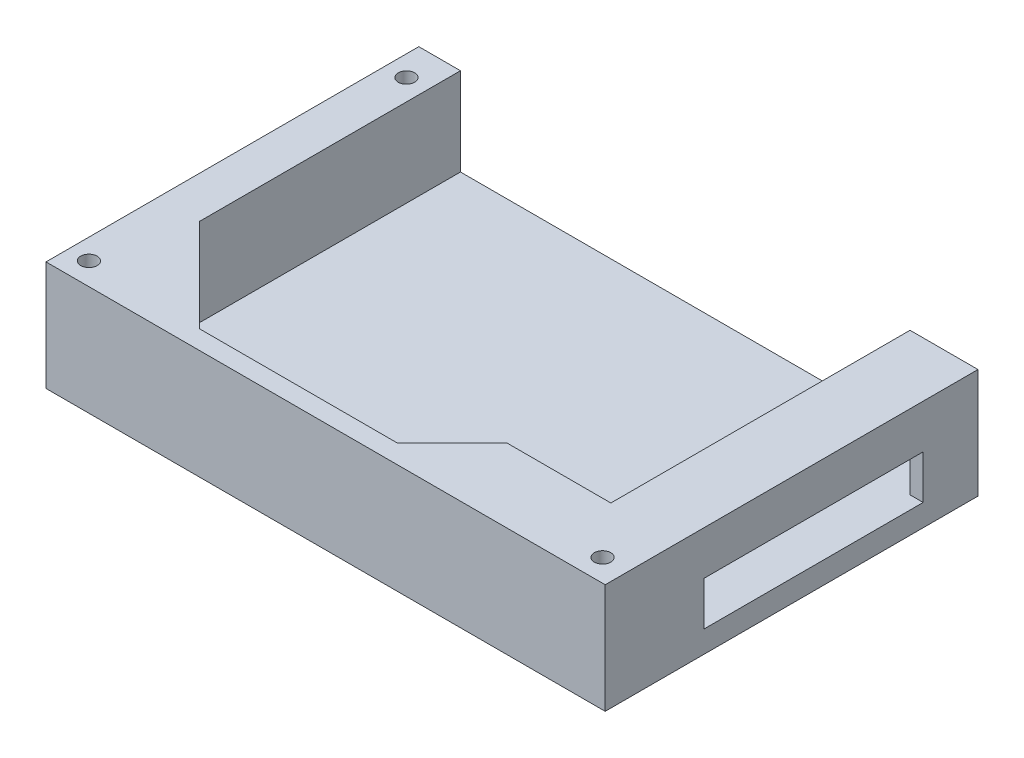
ISO-10303-21;
HEADER;
FILE_DESCRIPTION(('STEP AP214'),'2;1');
FILE_NAME('part.step','',(''),(''),'','','');
FILE_SCHEMA(('AUTOMOTIVE_DESIGN { 1 0 10303 214 1 1 1 1 }'));
ENDSEC;
DATA;
#1=APPLICATION_CONTEXT('core data for automotive mechanical design processes');
#2=APPLICATION_PROTOCOL_DEFINITION('international standard','automotive_design',2000,#1);
#3=PRODUCT_CONTEXT('',#1,'mechanical');
#4=PRODUCT('Part','Part','',(#3));
#5=PRODUCT_RELATED_PRODUCT_CATEGORY('part','',(#4));
#6=PRODUCT_DEFINITION_FORMATION('','',#4);
#7=PRODUCT_DEFINITION_CONTEXT('part definition',#1,'design');
#8=PRODUCT_DEFINITION('design','',#6,#7);
#9=PRODUCT_DEFINITION_SHAPE('','',#8);
#10=(LENGTH_UNIT() NAMED_UNIT(*) SI_UNIT(.MILLI.,.METRE.));
#11=(NAMED_UNIT(*) PLANE_ANGLE_UNIT() SI_UNIT($,.RADIAN.));
#12=(NAMED_UNIT(*) SI_UNIT($,.STERADIAN.) SOLID_ANGLE_UNIT());
#13=UNCERTAINTY_MEASURE_WITH_UNIT(LENGTH_MEASURE(1.E-05),#10,'distance_accuracy_value','');
#14=(GEOMETRIC_REPRESENTATION_CONTEXT(3) GLOBAL_UNCERTAINTY_ASSIGNED_CONTEXT((#13)) GLOBAL_UNIT_ASSIGNED_CONTEXT((#10,
#11,#12)) REPRESENTATION_CONTEXT('',''));
#15=CARTESIAN_POINT('',(0.,0.,0.));
#16=DIRECTION('',(0.,0.,1.));
#17=DIRECTION('',(1.,0.,0.));
#18=AXIS2_PLACEMENT_3D('',#15,#16,#17);
#19=CARTESIAN_POINT('',(0.,20.,0.));
#20=DIRECTION('',(0.,1.,0.));
#21=DIRECTION('',(0.,0.,1.));
#22=AXIS2_PLACEMENT_3D('',#19,#20,#21);
#23=PLANE('',#22);
#24=CARTESIAN_POINT('',(3.75,20.,-62.));
#25=DIRECTION('',(0.,1.,0.));
#26=DIRECTION('',(0.,0.,1.));
#27=AXIS2_PLACEMENT_3D('',#24,#25,#26);
#28=CIRCLE('',#27,1.5);
#29=CARTESIAN_POINT('',(3.75,20.,-60.5));
#30=VERTEX_POINT('',#29);
#31=EDGE_CURVE('E585',#30,#30,#28,.T.);
#32=ORIENTED_EDGE('',*,*,#31,.F.);
#33=EDGE_LOOP('',(#32));
#34=FACE_BOUND('',#33,.T.);
#35=CARTESIAN_POINT('',(3.75,20.,-4.07617639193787));
#36=DIRECTION('',(0.,1.,0.));
#37=DIRECTION('',(0.,0.,1.));
#38=AXIS2_PLACEMENT_3D('',#35,#36,#37);
#39=CIRCLE('',#38,1.5);
#40=CARTESIAN_POINT('',(3.75,20.,-2.57617639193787));
#41=VERTEX_POINT('',#40);
#42=EDGE_CURVE('E587',#41,#41,#39,.T.);
#43=ORIENTED_EDGE('',*,*,#42,.F.);
#44=EDGE_LOOP('',(#43));
#45=FACE_BOUND('',#44,.T.);
#46=CARTESIAN_POINT('',(97.441924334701,20.,-4.07617639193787));
#47=DIRECTION('',(0.,1.,0.));
#48=DIRECTION('',(0.,0.,1.));
#49=AXIS2_PLACEMENT_3D('',#46,#47,#48);
#50=CIRCLE('',#49,1.5);
#51=CARTESIAN_POINT('',(97.441924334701,20.,-2.57617639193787));
#52=VERTEX_POINT('',#51);
#53=EDGE_CURVE('E599',#52,#52,#50,.T.);
#54=ORIENTED_EDGE('',*,*,#53,.F.);
#55=EDGE_LOOP('',(#54));
#56=FACE_BOUND('',#55,.T.);
#57=DIRECTION('',(0.,0.,1.));
#58=VECTOR('',#57,1.);
#59=CARTESIAN_POINT('',(89.602187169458,20.,-68.));
#60=LINE('',#59,#58);
#61=CARTESIAN_POINT('',(89.602187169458,20.,-68.));
#62=VERTEX_POINT('',#61);
#63=CARTESIAN_POINT('',(89.602187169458,20.,-13.4315313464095));
#64=VERTEX_POINT('',#63);
#65=EDGE_CURVE('E215',#62,#64,#60,.T.);
#66=ORIENTED_EDGE('',*,*,#65,.T.);
#67=DIRECTION('',(-1.,0.,0.));
#68=VECTOR('',#67,1.);
#69=CARTESIAN_POINT('',(0.,20.,-13.4315313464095));
#70=LINE('',#69,#68);
#71=CARTESIAN_POINT('',(70.602187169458,20.,-13.4315313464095));
#72=VERTEX_POINT('',#71);
#73=EDGE_CURVE('E330',#64,#72,#70,.T.);
#74=ORIENTED_EDGE('',*,*,#73,.T.);
#75=DIRECTION('',(-0.707106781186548,0.,0.707106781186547));
#76=VECTOR('',#75,1.);
#77=CARTESIAN_POINT('',(28.5853279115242,20.,28.5853279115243));
#78=LINE('',#77,#76);
#79=CARTESIAN_POINT('',(60.602187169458,20.,-3.4315313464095));
#80=VERTEX_POINT('',#79);
#81=EDGE_CURVE('E333',#72,#80,#78,.T.);
#82=ORIENTED_EDGE('',*,*,#81,.T.);
#83=DIRECTION('',(-1.,0.,0.));
#84=VECTOR('',#83,1.);
#85=CARTESIAN_POINT('',(0.,20.,-3.4315313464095));
#86=LINE('',#85,#84);
#87=CARTESIAN_POINT('',(24.602187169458,20.,-3.4315313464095));
#88=VERTEX_POINT('',#87);
#89=EDGE_CURVE('E337',#80,#88,#86,.T.);
#90=ORIENTED_EDGE('',*,*,#89,.T.);
#91=DIRECTION('',(-0.707106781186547,0.,-0.707106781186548));
#92=VECTOR('',#91,1.);
#93=CARTESIAN_POINT('',(14.0168592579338,20.,-14.0168592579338));
#94=LINE('',#93,#92);
#95=CARTESIAN_POINT('',(7.60218716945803,20.,-20.4315313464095));
#96=VERTEX_POINT('',#95);
#97=EDGE_CURVE('E341',#88,#96,#94,.T.);
#98=ORIENTED_EDGE('',*,*,#97,.T.);
#99=DIRECTION('',(0.,0.,-1.));
#100=VECTOR('',#99,1.);
#101=CARTESIAN_POINT('',(7.60218716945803,20.,0.));
#102=LINE('',#101,#100);
#103=CARTESIAN_POINT('',(7.60218716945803,20.,-68.));
#104=VERTEX_POINT('',#103);
#105=EDGE_CURVE('E52',#96,#104,#102,.T.);
#106=ORIENTED_EDGE('',*,*,#105,.T.);
#107=DIRECTION('',(-1.,0.,0.));
#108=VECTOR('',#107,1.);
#109=CARTESIAN_POINT('',(102.,20.,-68.));
#110=LINE('',#109,#108);
#111=CARTESIAN_POINT('',(0.,20.,-68.));
#112=VERTEX_POINT('',#111);
#113=EDGE_CURVE('E68',#104,#112,#110,.T.);
#114=ORIENTED_EDGE('',*,*,#113,.T.);
#115=DIRECTION('',(0.,0.,1.));
#116=VECTOR('',#115,1.);
#117=CARTESIAN_POINT('',(0.,20.,-68.));
#118=LINE('',#117,#116);
#119=CARTESIAN_POINT('',(0.,20.,0.));
#120=VERTEX_POINT('',#119);
#121=EDGE_CURVE('E295',#112,#120,#118,.T.);
#122=ORIENTED_EDGE('',*,*,#121,.T.);
#123=DIRECTION('',(1.,0.,0.));
#124=VECTOR('',#123,1.);
#125=CARTESIAN_POINT('',(0.,20.,0.));
#126=LINE('',#125,#124);
#127=CARTESIAN_POINT('',(102.,20.,0.));
#128=VERTEX_POINT('',#127);
#129=EDGE_CURVE('E98',#120,#128,#126,.T.);
#130=ORIENTED_EDGE('',*,*,#129,.T.);
#131=DIRECTION('',(0.,0.,-1.));
#132=VECTOR('',#131,1.);
#133=CARTESIAN_POINT('',(102.,20.,0.));
#134=LINE('',#133,#132);
#135=CARTESIAN_POINT('',(102.,20.,-68.));
#136=VERTEX_POINT('',#135);
#137=EDGE_CURVE('E300',#128,#136,#134,.T.);
#138=ORIENTED_EDGE('',*,*,#137,.T.);
#139=EDGE_CURVE('E303',#136,#62,#110,.T.);
#140=ORIENTED_EDGE('',*,*,#139,.T.);
#141=EDGE_LOOP('',(#66,#74,#82,#90,#98,#106,#114,#122,#130,#138,#140));
#142=FACE_BOUND('',#141,.T.);
#143=ADVANCED_FACE('F43',(#34,#45,#56,#142),#23,.T.);
#144=CARTESIAN_POINT('',(0.,20.,-68.));
#145=DIRECTION('',(1.,0.,0.));
#146=DIRECTION('',(0.,0.,-1.));
#147=AXIS2_PLACEMENT_3D('',#144,#145,#146);
#148=PLANE('',#147);
#149=DIRECTION('',(0.,0.,1.));
#150=VECTOR('',#149,1.);
#151=CARTESIAN_POINT('',(0.,0.,-68.));
#152=LINE('',#151,#150);
#153=CARTESIAN_POINT('',(0.,0.,-68.));
#154=VERTEX_POINT('',#153);
#155=CARTESIAN_POINT('',(0.,0.,0.));
#156=VERTEX_POINT('',#155);
#157=EDGE_CURVE('E294',#154,#156,#152,.T.);
#158=ORIENTED_EDGE('',*,*,#157,.T.);
#159=DIRECTION('',(0.,-1.,0.));
#160=VECTOR('',#159,1.);
#161=CARTESIAN_POINT('',(0.,20.,0.));
#162=LINE('',#161,#160);
#163=EDGE_CURVE('E327',#120,#156,#162,.T.);
#164=ORIENTED_EDGE('',*,*,#163,.F.);
#165=ORIENTED_EDGE('',*,*,#121,.F.);
#166=DIRECTION('',(0.,-1.,0.));
#167=VECTOR('',#166,1.);
#168=CARTESIAN_POINT('',(0.,20.,-68.));
#169=LINE('',#168,#167);
#170=EDGE_CURVE('E306',#112,#154,#169,.T.);
#171=ORIENTED_EDGE('',*,*,#170,.T.);
#172=EDGE_LOOP('',(#158,#164,#165,#171));
#173=FACE_BOUND('',#172,.T.);
#174=ADVANCED_FACE('F45',(#173),#148,.F.);
#175=CARTESIAN_POINT('',(0.,20.,0.));
#176=DIRECTION('',(0.,0.,-1.));
#177=DIRECTION('',(-1.,0.,0.));
#178=AXIS2_PLACEMENT_3D('',#175,#176,#177);
#179=PLANE('',#178);
#180=DIRECTION('',(1.,0.,0.));
#181=VECTOR('',#180,1.);
#182=CARTESIAN_POINT('',(0.,0.,0.));
#183=LINE('',#182,#181);
#184=CARTESIAN_POINT('',(102.,0.,0.));
#185=VERTEX_POINT('',#184);
#186=EDGE_CURVE('E310',#156,#185,#183,.T.);
#187=ORIENTED_EDGE('',*,*,#186,.T.);
#188=DIRECTION('',(0.,-1.,0.));
#189=VECTOR('',#188,1.);
#190=CARTESIAN_POINT('',(102.,20.,0.));
#191=LINE('',#190,#189);
#192=EDGE_CURVE('E323',#128,#185,#191,.T.);
#193=ORIENTED_EDGE('',*,*,#192,.F.);
#194=ORIENTED_EDGE('',*,*,#129,.F.);
#195=ORIENTED_EDGE('',*,*,#163,.T.);
#196=EDGE_LOOP('',(#187,#193,#194,#195));
#197=FACE_BOUND('',#196,.T.);
#198=ADVANCED_FACE('F358',(#197),#179,.F.);
#199=CARTESIAN_POINT('',(102.,20.,0.));
#200=DIRECTION('',(-1.,0.,0.));
#201=DIRECTION('',(0.,0.,1.));
#202=AXIS2_PLACEMENT_3D('',#199,#200,#201);
#203=PLANE('',#202);
#204=DIRECTION('',(0.,0.,1.));
#205=VECTOR('',#204,1.);
#206=CARTESIAN_POINT('',(102.,12.,-58.));
#207=LINE('',#206,#205);
#208=CARTESIAN_POINT('',(102.,12.,-58.));
#209=VERTEX_POINT('',#208);
#210=CARTESIAN_POINT('',(102.,12.,-18.));
#211=VERTEX_POINT('',#210);
#212=EDGE_CURVE('E188',#209,#211,#207,.T.);
#213=ORIENTED_EDGE('',*,*,#212,.F.);
#214=DIRECTION('',(0.,1.,0.));
#215=VECTOR('',#214,1.);
#216=CARTESIAN_POINT('',(102.,12.,-58.));
#217=LINE('',#216,#215);
#218=CARTESIAN_POINT('',(102.,4.,-58.));
#219=VERTEX_POINT('',#218);
#220=EDGE_CURVE('E59',#219,#209,#217,.T.);
#221=ORIENTED_EDGE('',*,*,#220,.F.);
#222=DIRECTION('',(0.,0.,-1.));
#223=VECTOR('',#222,1.);
#224=CARTESIAN_POINT('',(102.,4.,-58.));
#225=LINE('',#224,#223);
#226=CARTESIAN_POINT('',(102.,3.99999999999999,-18.));
#227=VERTEX_POINT('',#226);
#228=EDGE_CURVE('E196',#227,#219,#225,.T.);
#229=ORIENTED_EDGE('',*,*,#228,.F.);
#230=DIRECTION('',(0.,-1.,0.));
#231=VECTOR('',#230,1.);
#232=CARTESIAN_POINT('',(102.,12.,-18.));
#233=LINE('',#232,#231);
#234=EDGE_CURVE('E177',#211,#227,#233,.T.);
#235=ORIENTED_EDGE('',*,*,#234,.F.);
#236=EDGE_LOOP('',(#213,#221,#229,#235));
#237=FACE_BOUND('',#236,.T.);
#238=DIRECTION('',(0.,0.,-1.));
#239=VECTOR('',#238,1.);
#240=CARTESIAN_POINT('',(102.,0.,0.));
#241=LINE('',#240,#239);
#242=CARTESIAN_POINT('',(102.,0.,-68.));
#243=VERTEX_POINT('',#242);
#244=EDGE_CURVE('E313',#185,#243,#241,.T.);
#245=ORIENTED_EDGE('',*,*,#244,.T.);
#246=DIRECTION('',(0.,-1.,0.));
#247=VECTOR('',#246,1.);
#248=CARTESIAN_POINT('',(102.,20.,-68.));
#249=LINE('',#248,#247);
#250=EDGE_CURVE('E320',#136,#243,#249,.T.);
#251=ORIENTED_EDGE('',*,*,#250,.F.);
#252=ORIENTED_EDGE('',*,*,#137,.F.);
#253=ORIENTED_EDGE('',*,*,#192,.T.);
#254=EDGE_LOOP('',(#245,#251,#252,#253));
#255=FACE_BOUND('',#254,.T.);
#256=ADVANCED_FACE('F193',(#237,#255),#203,.F.);
#257=CARTESIAN_POINT('',(102.,20.,-68.));
#258=DIRECTION('',(0.,0.,1.));
#259=DIRECTION('',(1.,0.,0.));
#260=AXIS2_PLACEMENT_3D('',#257,#258,#259);
#261=PLANE('',#260);
#262=DIRECTION('',(-1.,0.,0.));
#263=VECTOR('',#262,1.);
#264=CARTESIAN_POINT('',(99.602187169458,4.,-68.));
#265=LINE('',#264,#263);
#266=CARTESIAN_POINT('',(99.602187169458,4.,-68.));
#267=VERTEX_POINT('',#266);
#268=CARTESIAN_POINT('',(7.60218716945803,4.,-68.));
#269=VERTEX_POINT('',#268);
#270=EDGE_CURVE('E240',#267,#269,#265,.T.);
#271=ORIENTED_EDGE('',*,*,#270,.F.);
#272=DIRECTION('',(0.,1.,0.));
#273=VECTOR('',#272,1.);
#274=CARTESIAN_POINT('',(99.602187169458,4.,-68.));
#275=LINE('',#274,#273);
#276=CARTESIAN_POINT('',(99.602187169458,12.,-68.));
#277=VERTEX_POINT('',#276);
#278=EDGE_CURVE('E244',#267,#277,#275,.T.);
#279=ORIENTED_EDGE('',*,*,#278,.T.);
#280=DIRECTION('',(-1.,0.,0.));
#281=VECTOR('',#280,1.);
#282=CARTESIAN_POINT('',(99.602187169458,12.,-68.));
#283=LINE('',#282,#281);
#284=CARTESIAN_POINT('',(89.602187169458,12.,-68.));
#285=VERTEX_POINT('',#284);
#286=EDGE_CURVE('E216',#277,#285,#283,.T.);
#287=ORIENTED_EDGE('',*,*,#286,.T.);
#288=DIRECTION('',(0.,1.,0.));
#289=VECTOR('',#288,1.);
#290=CARTESIAN_POINT('',(89.602187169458,12.,-68.));
#291=LINE('',#290,#289);
#292=EDGE_CURVE('E227',#285,#62,#291,.T.);
#293=ORIENTED_EDGE('',*,*,#292,.T.);
#294=ORIENTED_EDGE('',*,*,#139,.F.);
#295=ORIENTED_EDGE('',*,*,#250,.T.);
#296=DIRECTION('',(-1.,0.,0.));
#297=VECTOR('',#296,1.);
#298=CARTESIAN_POINT('',(102.,0.,-68.));
#299=LINE('',#298,#297);
#300=EDGE_CURVE('E90',#243,#154,#299,.T.);
#301=ORIENTED_EDGE('',*,*,#300,.T.);
#302=ORIENTED_EDGE('',*,*,#170,.F.);
#303=ORIENTED_EDGE('',*,*,#113,.F.);
#304=DIRECTION('',(0.,1.,0.));
#305=VECTOR('',#304,1.);
#306=CARTESIAN_POINT('',(7.60218716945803,4.,-68.));
#307=LINE('',#306,#305);
#308=EDGE_CURVE('E245',#269,#104,#307,.T.);
#309=ORIENTED_EDGE('',*,*,#308,.F.);
#310=EDGE_LOOP('',(#271,#279,#287,#293,#294,#295,#301,#302,#303,#309));
#311=FACE_BOUND('',#310,.T.);
#312=ADVANCED_FACE('F350',(#311),#261,.F.);
#313=CARTESIAN_POINT('',(0.,0.,0.));
#314=DIRECTION('',(0.,1.,0.));
#315=DIRECTION('',(0.,0.,1.));
#316=AXIS2_PLACEMENT_3D('',#313,#314,#315);
#317=PLANE('',#316);
#318=CARTESIAN_POINT('',(3.75,0.,-62.));
#319=DIRECTION('',(0.,1.,0.));
#320=DIRECTION('',(0.,0.,1.));
#321=AXIS2_PLACEMENT_3D('',#318,#319,#320);
#322=CIRCLE('',#321,1.5);
#323=CARTESIAN_POINT('',(3.75,0.,-60.5));
#324=VERTEX_POINT('',#323);
#325=EDGE_CURVE('E583',#324,#324,#322,.T.);
#326=ORIENTED_EDGE('',*,*,#325,.T.);
#327=EDGE_LOOP('',(#326));
#328=FACE_BOUND('',#327,.T.);
#329=CARTESIAN_POINT('',(3.75,0.,-4.07617639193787));
#330=DIRECTION('',(0.,1.,0.));
#331=DIRECTION('',(0.,0.,1.));
#332=AXIS2_PLACEMENT_3D('',#329,#330,#331);
#333=CIRCLE('',#332,1.5);
#334=CARTESIAN_POINT('',(3.75,0.,-2.57617639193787));
#335=VERTEX_POINT('',#334);
#336=EDGE_CURVE('E593',#335,#335,#333,.T.);
#337=ORIENTED_EDGE('',*,*,#336,.T.);
#338=EDGE_LOOP('',(#337));
#339=FACE_BOUND('',#338,.T.);
#340=CARTESIAN_POINT('',(97.441924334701,0.,-4.07617639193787));
#341=DIRECTION('',(0.,1.,0.));
#342=DIRECTION('',(0.,0.,1.));
#343=AXIS2_PLACEMENT_3D('',#340,#341,#342);
#344=CIRCLE('',#343,1.5);
#345=CARTESIAN_POINT('',(97.441924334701,0.,-2.57617639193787));
#346=VERTEX_POINT('',#345);
#347=EDGE_CURVE('E603',#346,#346,#344,.T.);
#348=ORIENTED_EDGE('',*,*,#347,.T.);
#349=EDGE_LOOP('',(#348));
#350=FACE_BOUND('',#349,.T.);
#351=ORIENTED_EDGE('',*,*,#157,.F.);
#352=ORIENTED_EDGE('',*,*,#300,.F.);
#353=ORIENTED_EDGE('',*,*,#244,.F.);
#354=ORIENTED_EDGE('',*,*,#186,.F.);
#355=EDGE_LOOP('',(#351,#352,#353,#354));
#356=FACE_BOUND('',#355,.T.);
#357=ADVANCED_FACE('F413',(#328,#339,#350,#356),#317,.F.);
#358=CARTESIAN_POINT('',(7.60218716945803,20.000012,-54.4315313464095));
#359=DIRECTION('',(1.,0.,0.));
#360=DIRECTION('',(0.,0.,-1.));
#361=AXIS2_PLACEMENT_3D('',#358,#359,#360);
#362=PLANE('',#361);
#363=DIRECTION('',(0.,-1.,0.));
#364=VECTOR('',#363,1.);
#365=CARTESIAN_POINT('',(7.60218716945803,20.000012,-20.4315313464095));
#366=LINE('',#365,#364);
#367=CARTESIAN_POINT('',(7.60218716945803,4.,-20.4315313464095));
#368=VERTEX_POINT('',#367);
#369=EDGE_CURVE('E290',#96,#368,#366,.T.);
#370=ORIENTED_EDGE('',*,*,#369,.T.);
#371=DIRECTION('',(0.,0.,1.));
#372=VECTOR('',#371,1.);
#373=CARTESIAN_POINT('',(7.60218716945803,4.,-54.4315313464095));
#374=LINE('',#373,#372);
#375=EDGE_CURVE('E249',#269,#368,#374,.T.);
#376=ORIENTED_EDGE('',*,*,#375,.F.);
#377=ORIENTED_EDGE('',*,*,#308,.T.);
#378=ORIENTED_EDGE('',*,*,#105,.F.);
#379=EDGE_LOOP('',(#370,#376,#377,#378));
#380=FACE_BOUND('',#379,.T.);
#381=ADVANCED_FACE('F348',(#380),#362,.T.);
#382=CARTESIAN_POINT('',(7.60218716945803,20.000012,-20.4315313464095));
#383=DIRECTION('',(0.707106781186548,0.,-0.707106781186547));
#384=DIRECTION('',(-0.707106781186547,0.,-0.707106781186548));
#385=AXIS2_PLACEMENT_3D('',#382,#383,#384);
#386=PLANE('',#385);
#387=DIRECTION('',(0.,-1.,0.));
#388=VECTOR('',#387,1.);
#389=CARTESIAN_POINT('',(24.602187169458,20.000012,-3.4315313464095));
#390=LINE('',#389,#388);
#391=CARTESIAN_POINT('',(24.602187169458,4.,-3.4315313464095));
#392=VERTEX_POINT('',#391);
#393=EDGE_CURVE('E287',#88,#392,#390,.T.);
#394=ORIENTED_EDGE('',*,*,#393,.T.);
#395=DIRECTION('',(0.707106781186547,0.,0.707106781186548));
#396=VECTOR('',#395,1.);
#397=CARTESIAN_POINT('',(7.60218716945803,4.,-20.4315313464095));
#398=LINE('',#397,#396);
#399=EDGE_CURVE('E255',#368,#392,#398,.T.);
#400=ORIENTED_EDGE('',*,*,#399,.F.);
#401=ORIENTED_EDGE('',*,*,#369,.F.);
#402=ORIENTED_EDGE('',*,*,#97,.F.);
#403=EDGE_LOOP('',(#394,#400,#401,#402));
#404=FACE_BOUND('',#403,.T.);
#405=ADVANCED_FACE('F380',(#404),#386,.T.);
#406=CARTESIAN_POINT('',(24.602187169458,20.000012,-3.4315313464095));
#407=DIRECTION('',(0.,0.,-1.));
#408=DIRECTION('',(-1.,0.,0.));
#409=AXIS2_PLACEMENT_3D('',#406,#407,#408);
#410=PLANE('',#409);
#411=DIRECTION('',(0.,-1.,0.));
#412=VECTOR('',#411,1.);
#413=CARTESIAN_POINT('',(60.602187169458,20.000012,-3.4315313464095));
#414=LINE('',#413,#412);
#415=CARTESIAN_POINT('',(60.602187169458,4.,-3.4315313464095));
#416=VERTEX_POINT('',#415);
#417=EDGE_CURVE('E284',#80,#416,#414,.T.);
#418=ORIENTED_EDGE('',*,*,#417,.T.);
#419=DIRECTION('',(1.,0.,0.));
#420=VECTOR('',#419,1.);
#421=CARTESIAN_POINT('',(24.602187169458,4.,-3.4315313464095));
#422=LINE('',#421,#420);
#423=EDGE_CURVE('E259',#392,#416,#422,.T.);
#424=ORIENTED_EDGE('',*,*,#423,.F.);
#425=ORIENTED_EDGE('',*,*,#393,.F.);
#426=ORIENTED_EDGE('',*,*,#89,.F.);
#427=EDGE_LOOP('',(#418,#424,#425,#426));
#428=FACE_BOUND('',#427,.T.);
#429=ADVANCED_FACE('F376',(#428),#410,.T.);
#430=CARTESIAN_POINT('',(70.602187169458,20.000012,-13.4315313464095));
#431=DIRECTION('',(-0.707106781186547,0.,-0.707106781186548));
#432=DIRECTION('',(-0.707106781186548,0.,0.707106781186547));
#433=AXIS2_PLACEMENT_3D('',#430,#431,#432);
#434=PLANE('',#433);
#435=DIRECTION('',(0.,-1.,0.));
#436=VECTOR('',#435,1.);
#437=CARTESIAN_POINT('',(70.602187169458,20.000012,-13.4315313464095));
#438=LINE('',#437,#436);
#439=CARTESIAN_POINT('',(70.602187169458,4.,-13.4315313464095));
#440=VERTEX_POINT('',#439);
#441=EDGE_CURVE('E281',#72,#440,#438,.T.);
#442=ORIENTED_EDGE('',*,*,#441,.T.);
#443=DIRECTION('',(0.707106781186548,0.,-0.707106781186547));
#444=VECTOR('',#443,1.);
#445=CARTESIAN_POINT('',(70.602187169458,4.,-13.4315313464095));
#446=LINE('',#445,#444);
#447=EDGE_CURVE('E263',#416,#440,#446,.T.);
#448=ORIENTED_EDGE('',*,*,#447,.F.);
#449=ORIENTED_EDGE('',*,*,#417,.F.);
#450=ORIENTED_EDGE('',*,*,#81,.F.);
#451=EDGE_LOOP('',(#442,#448,#449,#450));
#452=FACE_BOUND('',#451,.T.);
#453=ADVANCED_FACE('F372',(#452),#434,.T.);
#454=CARTESIAN_POINT('',(93.602187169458,20.000012,-13.4315313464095));
#455=DIRECTION('',(0.,0.,-1.));
#456=DIRECTION('',(-1.,0.,0.));
#457=AXIS2_PLACEMENT_3D('',#454,#455,#456);
#458=PLANE('',#457);
#459=DIRECTION('',(0.,1.,0.));
#460=VECTOR('',#459,1.);
#461=CARTESIAN_POINT('',(89.602187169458,12.,-13.4315313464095));
#462=LINE('',#461,#460);
#463=CARTESIAN_POINT('',(89.602187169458,12.,-13.4315313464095));
#464=VERTEX_POINT('',#463);
#465=EDGE_CURVE('E231',#464,#64,#462,.T.);
#466=ORIENTED_EDGE('',*,*,#465,.F.);
#467=DIRECTION('',(1.,0.,0.));
#468=VECTOR('',#467,1.);
#469=CARTESIAN_POINT('',(99.602187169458,12.,-13.4315313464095));
#470=LINE('',#469,#468);
#471=CARTESIAN_POINT('',(93.602187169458,12.,-13.4315313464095));
#472=VERTEX_POINT('',#471);
#473=EDGE_CURVE('E223',#464,#472,#470,.T.);
#474=ORIENTED_EDGE('',*,*,#473,.T.);
#475=DIRECTION('',(0.,-1.,0.));
#476=VECTOR('',#475,1.);
#477=CARTESIAN_POINT('',(93.602187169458,20.000012,-13.4315313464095));
#478=LINE('',#477,#476);
#479=CARTESIAN_POINT('',(93.602187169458,4.,-13.4315313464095));
#480=VERTEX_POINT('',#479);
#481=EDGE_CURVE('E278',#472,#480,#478,.T.);
#482=ORIENTED_EDGE('',*,*,#481,.T.);
#483=DIRECTION('',(1.,0.,0.));
#484=VECTOR('',#483,1.);
#485=CARTESIAN_POINT('',(93.602187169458,4.,-13.4315313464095));
#486=LINE('',#485,#484);
#487=EDGE_CURVE('E267',#440,#480,#486,.T.);
#488=ORIENTED_EDGE('',*,*,#487,.F.);
#489=ORIENTED_EDGE('',*,*,#441,.F.);
#490=ORIENTED_EDGE('',*,*,#73,.F.);
#491=EDGE_LOOP('',(#466,#474,#482,#488,#489,#490));
#492=FACE_BOUND('',#491,.T.);
#493=ADVANCED_FACE('F368',(#492),#458,.T.);
#494=CARTESIAN_POINT('',(99.602187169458,20.000012,-19.4315313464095));
#495=DIRECTION('',(-0.707106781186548,0.,-0.707106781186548));
#496=DIRECTION('',(-0.707106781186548,0.,0.707106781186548));
#497=AXIS2_PLACEMENT_3D('',#494,#495,#496);
#498=PLANE('',#497);
#499=DIRECTION('',(0.,1.,0.));
#500=VECTOR('',#499,1.);
#501=CARTESIAN_POINT('',(98.1706558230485,20.000012,-18.));
#502=LINE('',#501,#500);
#503=CARTESIAN_POINT('',(98.1706558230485,3.99999999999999,-18.));
#504=VERTEX_POINT('',#503);
#505=CARTESIAN_POINT('',(98.1706558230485,12.,-18.));
#506=VERTEX_POINT('',#505);
#507=EDGE_CURVE('E180',#504,#506,#502,.T.);
#508=ORIENTED_EDGE('',*,*,#507,.F.);
#509=DIRECTION('',(0.707106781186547,0.,-0.707106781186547));
#510=VECTOR('',#509,1.);
#511=CARTESIAN_POINT('',(99.602187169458,4.,-19.4315313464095));
#512=LINE('',#511,#510);
#513=EDGE_CURVE('E271',#480,#504,#512,.T.);
#514=ORIENTED_EDGE('',*,*,#513,.F.);
#515=ORIENTED_EDGE('',*,*,#481,.F.);
#516=DIRECTION('',(-0.707106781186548,0.,0.707106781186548));
#517=VECTOR('',#516,1.);
#518=CARTESIAN_POINT('',(99.602187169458,12.,-19.4315313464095));
#519=LINE('',#518,#517);
#520=EDGE_CURVE('E234',#506,#472,#519,.T.);
#521=ORIENTED_EDGE('',*,*,#520,.F.);
#522=EDGE_LOOP('',(#508,#514,#515,#521));
#523=FACE_BOUND('',#522,.T.);
#524=ADVANCED_FACE('F467',(#523),#498,.T.);
#525=CARTESIAN_POINT('',(99.602187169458,20.000012,-47.4315313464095));
#526=DIRECTION('',(-1.,0.,0.));
#527=DIRECTION('',(0.,0.,1.));
#528=AXIS2_PLACEMENT_3D('',#525,#526,#527);
#529=PLANE('',#528);
#530=DIRECTION('',(0.,-1.,0.));
#531=VECTOR('',#530,1.);
#532=CARTESIAN_POINT('',(99.602187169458,20.000012,-58.));
#533=LINE('',#532,#531);
#534=CARTESIAN_POINT('',(99.602187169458,12.,-58.));
#535=VERTEX_POINT('',#534);
#536=CARTESIAN_POINT('',(99.602187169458,4.,-58.));
#537=VERTEX_POINT('',#536);
#538=EDGE_CURVE('E212',#535,#537,#533,.T.);
#539=ORIENTED_EDGE('',*,*,#538,.F.);
#540=DIRECTION('',(0.,0.,1.));
#541=VECTOR('',#540,1.);
#542=CARTESIAN_POINT('',(99.602187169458,12.,-47.4315313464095));
#543=LINE('',#542,#541);
#544=EDGE_CURVE('E11',#277,#535,#543,.T.);
#545=ORIENTED_EDGE('',*,*,#544,.F.);
#546=ORIENTED_EDGE('',*,*,#278,.F.);
#547=DIRECTION('',(0.,0.,-1.));
#548=VECTOR('',#547,1.);
#549=CARTESIAN_POINT('',(99.602187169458,4.,-47.4315313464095));
#550=LINE('',#549,#548);
#551=EDGE_CURVE('E275',#537,#267,#550,.T.);
#552=ORIENTED_EDGE('',*,*,#551,.F.);
#553=EDGE_LOOP('',(#539,#545,#546,#552));
#554=FACE_BOUND('',#553,.T.);
#555=ADVANCED_FACE('F389',(#554),#529,.T.);
#556=CARTESIAN_POINT('',(0.,3.99999999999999,0.));
#557=DIRECTION('',(0.,1.,0.));
#558=DIRECTION('',(0.,0.,1.));
#559=AXIS2_PLACEMENT_3D('',#556,#557,#558);
#560=PLANE('',#559);
#561=ORIENTED_EDGE('',*,*,#513,.T.);
#562=DIRECTION('',(1.,0.,0.));
#563=VECTOR('',#562,1.);
#564=CARTESIAN_POINT('',(94.,3.99999999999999,-18.));
#565=LINE('',#564,#563);
#566=EDGE_CURVE('E184',#504,#227,#565,.T.);
#567=ORIENTED_EDGE('',*,*,#566,.T.);
#568=ORIENTED_EDGE('',*,*,#228,.T.);
#569=DIRECTION('',(1.,0.,0.));
#570=VECTOR('',#569,1.);
#571=CARTESIAN_POINT('',(94.,4.,-58.));
#572=LINE('',#571,#570);
#573=EDGE_CURVE('E203',#537,#219,#572,.T.);
#574=ORIENTED_EDGE('',*,*,#573,.F.);
#575=ORIENTED_EDGE('',*,*,#551,.T.);
#576=ORIENTED_EDGE('',*,*,#270,.T.);
#577=ORIENTED_EDGE('',*,*,#375,.T.);
#578=ORIENTED_EDGE('',*,*,#399,.T.);
#579=ORIENTED_EDGE('',*,*,#423,.T.);
#580=ORIENTED_EDGE('',*,*,#447,.T.);
#581=ORIENTED_EDGE('',*,*,#487,.T.);
#582=EDGE_LOOP('',(#561,#567,#568,#574,#575,#576,#577,#578,#579,#580,#581));
#583=FACE_BOUND('',#582,.T.);
#584=ADVANCED_FACE('F382',(#583),#560,.T.);
#585=CARTESIAN_POINT('',(89.602187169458,12.,-68.));
#586=DIRECTION('',(-1.,0.,0.));
#587=DIRECTION('',(0.,0.,1.));
#588=AXIS2_PLACEMENT_3D('',#585,#586,#587);
#589=PLANE('',#588);
#590=ORIENTED_EDGE('',*,*,#65,.F.);
#591=ORIENTED_EDGE('',*,*,#292,.F.);
#592=DIRECTION('',(0.,0.,1.));
#593=VECTOR('',#592,1.);
#594=CARTESIAN_POINT('',(89.602187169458,12.,-68.));
#595=LINE('',#594,#593);
#596=EDGE_CURVE('E220',#285,#464,#595,.T.);
#597=ORIENTED_EDGE('',*,*,#596,.T.);
#598=ORIENTED_EDGE('',*,*,#465,.T.);
#599=EDGE_LOOP('',(#590,#591,#597,#598));
#600=FACE_BOUND('',#599,.T.);
#601=ADVANCED_FACE('F392',(#600),#589,.T.);
#602=CARTESIAN_POINT('',(0.,12.,0.));
#603=DIRECTION('',(0.,-1.,0.));
#604=DIRECTION('',(0.,0.,-1.));
#605=AXIS2_PLACEMENT_3D('',#602,#603,#604);
#606=PLANE('',#605);
#607=DIRECTION('',(1.,0.,0.));
#608=VECTOR('',#607,1.);
#609=CARTESIAN_POINT('',(94.,12.,-18.));
#610=LINE('',#609,#608);
#611=EDGE_CURVE('E173',#506,#211,#610,.T.);
#612=ORIENTED_EDGE('',*,*,#611,.F.);
#613=ORIENTED_EDGE('',*,*,#520,.T.);
#614=ORIENTED_EDGE('',*,*,#473,.F.);
#615=ORIENTED_EDGE('',*,*,#596,.F.);
#616=ORIENTED_EDGE('',*,*,#286,.F.);
#617=ORIENTED_EDGE('',*,*,#544,.T.);
#618=DIRECTION('',(1.,0.,0.));
#619=VECTOR('',#618,1.);
#620=CARTESIAN_POINT('',(94.,12.,-58.));
#621=LINE('',#620,#619);
#622=EDGE_CURVE('E185',#535,#209,#621,.T.);
#623=ORIENTED_EDGE('',*,*,#622,.T.);
#624=ORIENTED_EDGE('',*,*,#212,.T.);
#625=EDGE_LOOP('',(#612,#613,#614,#615,#616,#617,#623,#624));
#626=FACE_BOUND('',#625,.T.);
#627=ADVANCED_FACE('F189',(#626),#606,.T.);
#628=CARTESIAN_POINT('',(94.,12.,-58.));
#629=DIRECTION('',(0.,0.,-1.));
#630=DIRECTION('',(-1.,0.,0.));
#631=AXIS2_PLACEMENT_3D('',#628,#629,#630);
#632=PLANE('',#631);
#633=ORIENTED_EDGE('',*,*,#538,.T.);
#634=ORIENTED_EDGE('',*,*,#573,.T.);
#635=ORIENTED_EDGE('',*,*,#220,.T.);
#636=ORIENTED_EDGE('',*,*,#622,.F.);
#637=EDGE_LOOP('',(#633,#634,#635,#636));
#638=FACE_BOUND('',#637,.T.);
#639=ADVANCED_FACE('F399',(#638),#632,.F.);
#640=CARTESIAN_POINT('',(94.,12.,-18.));
#641=DIRECTION('',(0.,0.,1.));
#642=DIRECTION('',(1.,0.,0.));
#643=AXIS2_PLACEMENT_3D('',#640,#641,#642);
#644=PLANE('',#643);
#645=ORIENTED_EDGE('',*,*,#507,.T.);
#646=ORIENTED_EDGE('',*,*,#611,.T.);
#647=ORIENTED_EDGE('',*,*,#234,.T.);
#648=ORIENTED_EDGE('',*,*,#566,.F.);
#649=EDGE_LOOP('',(#645,#646,#647,#648));
#650=FACE_BOUND('',#649,.T.);
#651=ADVANCED_FACE('F175',(#650),#644,.F.);
#652=CARTESIAN_POINT('',(97.441924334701,0.,-4.07617639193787));
#653=DIRECTION('',(0.,1.,0.));
#654=DIRECTION('',(0.,0.,1.));
#655=AXIS2_PLACEMENT_3D('',#652,#653,#654);
#656=CYLINDRICAL_SURFACE('',#655,1.5);
#657=ORIENTED_EDGE('',*,*,#347,.F.);
#658=EDGE_LOOP('',(#657));
#659=FACE_BOUND('',#658,.T.);
#660=ORIENTED_EDGE('',*,*,#53,.T.);
#661=EDGE_LOOP('',(#660));
#662=FACE_BOUND('',#661,.T.);
#663=ADVANCED_FACE('F509',(#659,#662),#656,.F.);
#664=CARTESIAN_POINT('',(3.75,0.,-4.07617639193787));
#665=DIRECTION('',(0.,1.,0.));
#666=DIRECTION('',(0.,0.,1.));
#667=AXIS2_PLACEMENT_3D('',#664,#665,#666);
#668=CYLINDRICAL_SURFACE('',#667,1.5);
#669=ORIENTED_EDGE('',*,*,#336,.F.);
#670=EDGE_LOOP('',(#669));
#671=FACE_BOUND('',#670,.T.);
#672=ORIENTED_EDGE('',*,*,#42,.T.);
#673=EDGE_LOOP('',(#672));
#674=FACE_BOUND('',#673,.T.);
#675=ADVANCED_FACE('F551',(#671,#674),#668,.F.);
#676=CARTESIAN_POINT('',(3.75,0.,-62.));
#677=DIRECTION('',(0.,1.,0.));
#678=DIRECTION('',(0.,0.,1.));
#679=AXIS2_PLACEMENT_3D('',#676,#677,#678);
#680=CYLINDRICAL_SURFACE('',#679,1.5);
#681=ORIENTED_EDGE('',*,*,#325,.F.);
#682=EDGE_LOOP('',(#681));
#683=FACE_BOUND('',#682,.T.);
#684=ORIENTED_EDGE('',*,*,#31,.T.);
#685=EDGE_LOOP('',(#684));
#686=FACE_BOUND('',#685,.T.);
#687=ADVANCED_FACE('F560',(#683,#686),#680,.F.);
#688=CLOSED_SHELL('',(#143,#174,#198,#256,#312,#357,#381,#405,#429,#453,#493,#524,#555,#584,
#601,#627,#639,#651,#663,#675,#687));
#689=MANIFOLD_SOLID_BREP('B2',#688);
#690=ADVANCED_BREP_SHAPE_REPRESENTATION('',(#18,#689),#14);
#691=SHAPE_DEFINITION_REPRESENTATION(#9,#690);
ENDSEC;
END-ISO-10303-21;
